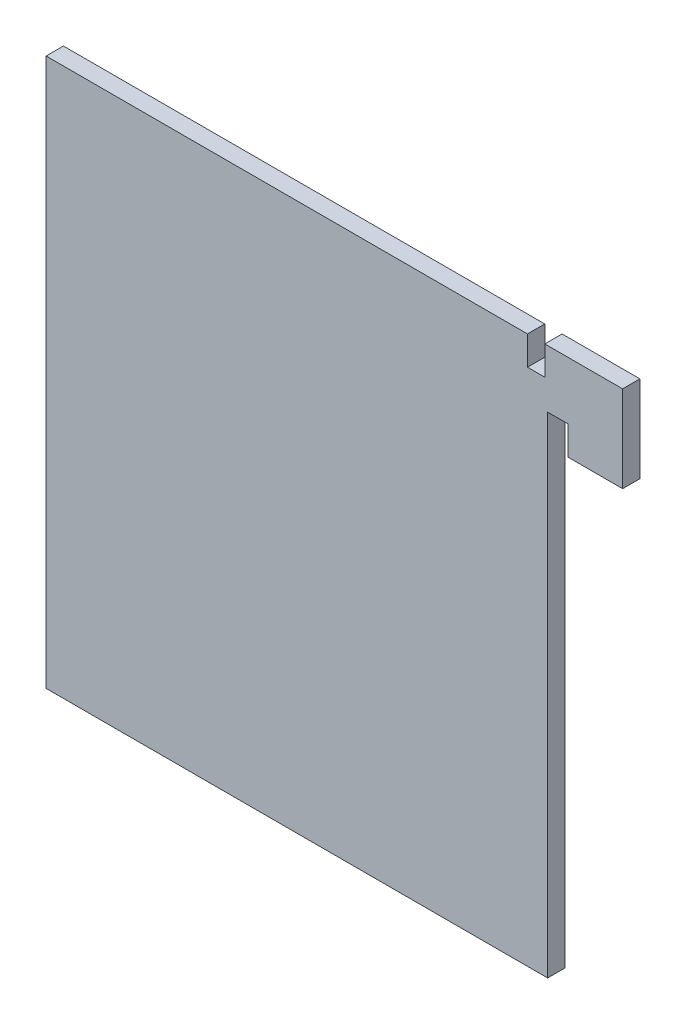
ISO-10303-21;
HEADER;
FILE_DESCRIPTION(('STEP AP214'),'2;1');
FILE_NAME('part.step','',(''),(''),'','','');
FILE_SCHEMA(('AUTOMOTIVE_DESIGN { 1 0 10303 214 1 1 1 1 }'));
ENDSEC;
DATA;
#1=APPLICATION_CONTEXT('core data for automotive mechanical design processes');
#2=APPLICATION_PROTOCOL_DEFINITION('international standard','automotive_design',2000,#1);
#3=PRODUCT_CONTEXT('',#1,'mechanical');
#4=PRODUCT('Part','Part','',(#3));
#5=PRODUCT_RELATED_PRODUCT_CATEGORY('part','',(#4));
#6=PRODUCT_DEFINITION_FORMATION('','',#4);
#7=PRODUCT_DEFINITION_CONTEXT('part definition',#1,'design');
#8=PRODUCT_DEFINITION('design','',#6,#7);
#9=PRODUCT_DEFINITION_SHAPE('','',#8);
#10=(LENGTH_UNIT() NAMED_UNIT(*) SI_UNIT(.MILLI.,.METRE.));
#11=(NAMED_UNIT(*) PLANE_ANGLE_UNIT() SI_UNIT($,.RADIAN.));
#12=(NAMED_UNIT(*) SI_UNIT($,.STERADIAN.) SOLID_ANGLE_UNIT());
#13=UNCERTAINTY_MEASURE_WITH_UNIT(LENGTH_MEASURE(1.E-05),#10,'distance_accuracy_value','');
#14=(GEOMETRIC_REPRESENTATION_CONTEXT(3) GLOBAL_UNCERTAINTY_ASSIGNED_CONTEXT((#13)) GLOBAL_UNIT_ASSIGNED_CONTEXT((#10,
#11,#12)) REPRESENTATION_CONTEXT('',''));
#15=CARTESIAN_POINT('',(0.,0.,0.));
#16=DIRECTION('',(0.,0.,1.));
#17=DIRECTION('',(1.,0.,0.));
#18=AXIS2_PLACEMENT_3D('',#15,#16,#17);
#19=CARTESIAN_POINT('',(0.,95.,3.));
#20=DIRECTION('',(0.,-1.,0.));
#21=DIRECTION('',(0.,0.,-1.));
#22=AXIS2_PLACEMENT_3D('',#19,#20,#21);
#23=PLANE('',#22);
#24=DIRECTION('',(-1.,0.,0.));
#25=VECTOR('',#24,1.);
#26=CARTESIAN_POINT('',(0.,95.,3.));
#27=LINE('',#26,#25);
#28=CARTESIAN_POINT('',(83.5,95.,3.));
#29=VERTEX_POINT('',#28);
#30=CARTESIAN_POINT('',(0.,95.,3.));
#31=VERTEX_POINT('',#30);
#32=EDGE_CURVE('E195',#29,#31,#27,.T.);
#33=ORIENTED_EDGE('',*,*,#32,.F.);
#34=DIRECTION('',(0.,0.,1.));
#35=VECTOR('',#34,1.);
#36=CARTESIAN_POINT('',(83.5,95.,0.));
#37=LINE('',#36,#35);
#38=CARTESIAN_POINT('',(83.5,95.,0.));
#39=VERTEX_POINT('',#38);
#40=EDGE_CURVE('E177',#39,#29,#37,.T.);
#41=ORIENTED_EDGE('',*,*,#40,.F.);
#42=DIRECTION('',(-1.,0.,0.));
#43=VECTOR('',#42,1.);
#44=CARTESIAN_POINT('',(0.,95.,0.));
#45=LINE('',#44,#43);
#46=CARTESIAN_POINT('',(0.,95.,0.));
#47=VERTEX_POINT('',#46);
#48=EDGE_CURVE('E207',#39,#47,#45,.T.);
#49=ORIENTED_EDGE('',*,*,#48,.T.);
#50=DIRECTION('',(0.,0.,-1.));
#51=VECTOR('',#50,1.);
#52=CARTESIAN_POINT('',(0.,95.,3.));
#53=LINE('',#52,#51);
#54=EDGE_CURVE('E199',#31,#47,#53,.T.);
#55=ORIENTED_EDGE('',*,*,#54,.F.);
#56=EDGE_LOOP('',(#33,#41,#49,#55));
#57=FACE_BOUND('',#56,.T.);
#58=ADVANCED_FACE('F31',(#57),#23,.F.);
#59=CARTESIAN_POINT('',(0.,0.,3.));
#60=DIRECTION('',(1.,0.,0.));
#61=DIRECTION('',(0.,0.,-1.));
#62=AXIS2_PLACEMENT_3D('',#59,#60,#61);
#63=PLANE('',#62);
#64=DIRECTION('',(0.,-1.,0.));
#65=VECTOR('',#64,1.);
#66=CARTESIAN_POINT('',(0.,0.,0.));
#67=LINE('',#66,#65);
#68=CARTESIAN_POINT('',(0.,0.,0.));
#69=VERTEX_POINT('',#68);
#70=EDGE_CURVE('E179',#47,#69,#67,.T.);
#71=ORIENTED_EDGE('',*,*,#70,.T.);
#72=DIRECTION('',(0.,0.,-1.));
#73=VECTOR('',#72,1.);
#74=CARTESIAN_POINT('',(0.,0.,3.));
#75=LINE('',#74,#73);
#76=CARTESIAN_POINT('',(0.,0.,3.));
#77=VERTEX_POINT('',#76);
#78=EDGE_CURVE('E11',#77,#69,#75,.T.);
#79=ORIENTED_EDGE('',*,*,#78,.F.);
#80=DIRECTION('',(0.,-1.,0.));
#81=VECTOR('',#80,1.);
#82=CARTESIAN_POINT('',(0.,0.,3.));
#83=LINE('',#82,#81);
#84=EDGE_CURVE('E186',#31,#77,#83,.T.);
#85=ORIENTED_EDGE('',*,*,#84,.F.);
#86=ORIENTED_EDGE('',*,*,#54,.T.);
#87=EDGE_LOOP('',(#71,#79,#85,#86));
#88=FACE_BOUND('',#87,.T.);
#89=ADVANCED_FACE('F33',(#88),#63,.F.);
#90=CARTESIAN_POINT('',(0.,0.,3.));
#91=DIRECTION('',(0.,1.,0.));
#92=DIRECTION('',(0.,0.,1.));
#93=AXIS2_PLACEMENT_3D('',#90,#91,#92);
#94=PLANE('',#93);
#95=DIRECTION('',(1.,0.,0.));
#96=VECTOR('',#95,1.);
#97=CARTESIAN_POINT('',(0.,0.,0.));
#98=LINE('',#97,#96);
#99=CARTESIAN_POINT('',(87.,0.,0.));
#100=VERTEX_POINT('',#99);
#101=EDGE_CURVE('E202',#69,#100,#98,.T.);
#102=ORIENTED_EDGE('',*,*,#101,.T.);
#103=DIRECTION('',(0.,0.,1.));
#104=VECTOR('',#103,1.);
#105=CARTESIAN_POINT('',(87.,0.,0.));
#106=LINE('',#105,#104);
#107=CARTESIAN_POINT('',(87.,0.,3.));
#108=VERTEX_POINT('',#107);
#109=EDGE_CURVE('E157',#100,#108,#106,.T.);
#110=ORIENTED_EDGE('',*,*,#109,.T.);
#111=DIRECTION('',(1.,0.,0.));
#112=VECTOR('',#111,1.);
#113=CARTESIAN_POINT('',(0.,0.,3.));
#114=LINE('',#113,#112);
#115=EDGE_CURVE('E189',#77,#108,#114,.T.);
#116=ORIENTED_EDGE('',*,*,#115,.F.);
#117=ORIENTED_EDGE('',*,*,#78,.T.);
#118=EDGE_LOOP('',(#102,#110,#116,#117));
#119=FACE_BOUND('',#118,.T.);
#120=ADVANCED_FACE('F237',(#119),#94,.F.);
#121=CARTESIAN_POINT('',(100.,0.,3.));
#122=DIRECTION('',(-1.,0.,0.));
#123=DIRECTION('',(0.,0.,1.));
#124=AXIS2_PLACEMENT_3D('',#121,#122,#123);
#125=PLANE('',#124);
#126=DIRECTION('',(0.,1.,0.));
#127=VECTOR('',#126,1.);
#128=CARTESIAN_POINT('',(100.,0.,3.));
#129=LINE('',#128,#127);
#130=CARTESIAN_POINT('',(100.,80.,3.));
#131=VERTEX_POINT('',#130);
#132=CARTESIAN_POINT('',(100.,95.,3.));
#133=VERTEX_POINT('',#132);
#134=EDGE_CURVE('E193',#131,#133,#129,.T.);
#135=ORIENTED_EDGE('',*,*,#134,.F.);
#136=DIRECTION('',(0.,0.,1.));
#137=VECTOR('',#136,1.);
#138=CARTESIAN_POINT('',(100.,80.,0.));
#139=LINE('',#138,#137);
#140=CARTESIAN_POINT('',(100.,80.,0.));
#141=VERTEX_POINT('',#140);
#142=EDGE_CURVE('E153',#141,#131,#139,.T.);
#143=ORIENTED_EDGE('',*,*,#142,.F.);
#144=DIRECTION('',(0.,1.,0.));
#145=VECTOR('',#144,1.);
#146=CARTESIAN_POINT('',(100.,0.,0.));
#147=LINE('',#146,#145);
#148=CARTESIAN_POINT('',(100.,95.,0.));
#149=VERTEX_POINT('',#148);
#150=EDGE_CURVE('E205',#141,#149,#147,.T.);
#151=ORIENTED_EDGE('',*,*,#150,.T.);
#152=DIRECTION('',(0.,0.,-1.));
#153=VECTOR('',#152,1.);
#154=CARTESIAN_POINT('',(100.,95.,3.));
#155=LINE('',#154,#153);
#156=EDGE_CURVE('E39',#133,#149,#155,.T.);
#157=ORIENTED_EDGE('',*,*,#156,.F.);
#158=EDGE_LOOP('',(#135,#143,#151,#157));
#159=FACE_BOUND('',#158,.T.);
#160=ADVANCED_FACE('F230',(#159),#125,.F.);
#161=CARTESIAN_POINT('',(86.5,95.,0.));
#162=VERTEX_POINT('',#161);
#163=EDGE_CURVE('E190',#149,#162,#45,.T.);
#164=ORIENTED_EDGE('',*,*,#163,.T.);
#165=DIRECTION('',(0.,0.,1.));
#166=VECTOR('',#165,1.);
#167=CARTESIAN_POINT('',(86.5,95.,0.));
#168=LINE('',#167,#166);
#169=CARTESIAN_POINT('',(86.5,95.,3.));
#170=VERTEX_POINT('',#169);
#171=EDGE_CURVE('E180',#162,#170,#168,.T.);
#172=ORIENTED_EDGE('',*,*,#171,.T.);
#173=EDGE_CURVE('E196',#133,#170,#27,.T.);
#174=ORIENTED_EDGE('',*,*,#173,.F.);
#175=ORIENTED_EDGE('',*,*,#156,.T.);
#176=EDGE_LOOP('',(#164,#172,#174,#175));
#177=FACE_BOUND('',#176,.T.);
#178=ADVANCED_FACE('F216',(#177),#23,.F.);
#179=CARTESIAN_POINT('',(0.,95.,3.));
#180=DIRECTION('',(0.,0.,-1.));
#181=DIRECTION('',(-1.,0.,0.));
#182=AXIS2_PLACEMENT_3D('',#179,#180,#181);
#183=PLANE('',#182);
#184=DIRECTION('',(0.,-1.,0.));
#185=VECTOR('',#184,1.);
#186=CARTESIAN_POINT('',(87.,80.,3.));
#187=LINE('',#186,#185);
#188=CARTESIAN_POINT('',(87.,85.,3.));
#189=VERTEX_POINT('',#188);
#190=EDGE_CURVE('E151',#189,#108,#187,.T.);
#191=ORIENTED_EDGE('',*,*,#190,.F.);
#192=DIRECTION('',(-1.,0.,0.));
#193=VECTOR('',#192,1.);
#194=CARTESIAN_POINT('',(87.,85.,3.));
#195=LINE('',#194,#193);
#196=CARTESIAN_POINT('',(90.5,85.,3.));
#197=VERTEX_POINT('',#196);
#198=EDGE_CURVE('E141',#197,#189,#195,.T.);
#199=ORIENTED_EDGE('',*,*,#198,.F.);
#200=DIRECTION('',(0.,1.,0.));
#201=VECTOR('',#200,1.);
#202=CARTESIAN_POINT('',(90.5,80.,3.));
#203=LINE('',#202,#201);
#204=CARTESIAN_POINT('',(90.5,80.,3.));
#205=VERTEX_POINT('',#204);
#206=EDGE_CURVE('E122',#205,#197,#203,.T.);
#207=ORIENTED_EDGE('',*,*,#206,.F.);
#208=DIRECTION('',(-1.,0.,0.));
#209=VECTOR('',#208,1.);
#210=CARTESIAN_POINT('',(100.,80.,3.));
#211=LINE('',#210,#209);
#212=EDGE_CURVE('E146',#131,#205,#211,.T.);
#213=ORIENTED_EDGE('',*,*,#212,.F.);
#214=ORIENTED_EDGE('',*,*,#134,.T.);
#215=ORIENTED_EDGE('',*,*,#173,.T.);
#216=DIRECTION('',(0.,1.,0.));
#217=VECTOR('',#216,1.);
#218=CARTESIAN_POINT('',(86.5,95.,3.));
#219=LINE('',#218,#217);
#220=CARTESIAN_POINT('',(86.5,90.,3.));
#221=VERTEX_POINT('',#220);
#222=EDGE_CURVE('E166',#221,#170,#219,.T.);
#223=ORIENTED_EDGE('',*,*,#222,.F.);
#224=DIRECTION('',(1.,0.,0.));
#225=VECTOR('',#224,1.);
#226=CARTESIAN_POINT('',(83.5,90.,3.));
#227=LINE('',#226,#225);
#228=CARTESIAN_POINT('',(83.5,90.,3.));
#229=VERTEX_POINT('',#228);
#230=EDGE_CURVE('E173',#229,#221,#227,.T.);
#231=ORIENTED_EDGE('',*,*,#230,.F.);
#232=DIRECTION('',(0.,-1.,0.));
#233=VECTOR('',#232,1.);
#234=CARTESIAN_POINT('',(83.5,95.,3.));
#235=LINE('',#234,#233);
#236=EDGE_CURVE('E160',#29,#229,#235,.T.);
#237=ORIENTED_EDGE('',*,*,#236,.F.);
#238=ORIENTED_EDGE('',*,*,#32,.T.);
#239=ORIENTED_EDGE('',*,*,#84,.T.);
#240=ORIENTED_EDGE('',*,*,#115,.T.);
#241=EDGE_LOOP('',(#191,#199,#207,#213,#214,#215,#223,#231,#237,#238,#239,#240));
#242=FACE_BOUND('',#241,.T.);
#243=ADVANCED_FACE('F227',(#242),#183,.F.);
#244=CARTESIAN_POINT('',(0.,95.,0.));
#245=DIRECTION('',(0.,0.,-1.));
#246=DIRECTION('',(-1.,0.,0.));
#247=AXIS2_PLACEMENT_3D('',#244,#245,#246);
#248=PLANE('',#247);
#249=DIRECTION('',(-1.,0.,0.));
#250=VECTOR('',#249,1.);
#251=CARTESIAN_POINT('',(87.,85.,0.));
#252=LINE('',#251,#250);
#253=CARTESIAN_POINT('',(90.5,85.,0.));
#254=VERTEX_POINT('',#253);
#255=CARTESIAN_POINT('',(87.,85.,0.));
#256=VERTEX_POINT('',#255);
#257=EDGE_CURVE('E131',#254,#256,#252,.T.);
#258=ORIENTED_EDGE('',*,*,#257,.T.);
#259=DIRECTION('',(0.,-1.,0.));
#260=VECTOR('',#259,1.);
#261=CARTESIAN_POINT('',(87.,80.,0.));
#262=LINE('',#261,#260);
#263=EDGE_CURVE('E150',#256,#100,#262,.T.);
#264=ORIENTED_EDGE('',*,*,#263,.T.);
#265=ORIENTED_EDGE('',*,*,#101,.F.);
#266=ORIENTED_EDGE('',*,*,#70,.F.);
#267=ORIENTED_EDGE('',*,*,#48,.F.);
#268=DIRECTION('',(0.,-1.,0.));
#269=VECTOR('',#268,1.);
#270=CARTESIAN_POINT('',(83.5,95.,0.));
#271=LINE('',#270,#269);
#272=CARTESIAN_POINT('',(83.5,90.,0.));
#273=VERTEX_POINT('',#272);
#274=EDGE_CURVE('E162',#39,#273,#271,.T.);
#275=ORIENTED_EDGE('',*,*,#274,.T.);
#276=DIRECTION('',(1.,0.,0.));
#277=VECTOR('',#276,1.);
#278=CARTESIAN_POINT('',(83.5,90.,0.));
#279=LINE('',#278,#277);
#280=CARTESIAN_POINT('',(86.5,90.,0.));
#281=VERTEX_POINT('',#280);
#282=EDGE_CURVE('E165',#273,#281,#279,.T.);
#283=ORIENTED_EDGE('',*,*,#282,.T.);
#284=DIRECTION('',(0.,1.,0.));
#285=VECTOR('',#284,1.);
#286=CARTESIAN_POINT('',(86.5,95.,0.));
#287=LINE('',#286,#285);
#288=EDGE_CURVE('E54',#281,#162,#287,.T.);
#289=ORIENTED_EDGE('',*,*,#288,.T.);
#290=ORIENTED_EDGE('',*,*,#163,.F.);
#291=ORIENTED_EDGE('',*,*,#150,.F.);
#292=DIRECTION('',(-1.,0.,0.));
#293=VECTOR('',#292,1.);
#294=CARTESIAN_POINT('',(100.,80.,0.));
#295=LINE('',#294,#293);
#296=CARTESIAN_POINT('',(90.5,80.,0.));
#297=VERTEX_POINT('',#296);
#298=EDGE_CURVE('E140',#141,#297,#295,.T.);
#299=ORIENTED_EDGE('',*,*,#298,.T.);
#300=DIRECTION('',(0.,1.,0.));
#301=VECTOR('',#300,1.);
#302=CARTESIAN_POINT('',(90.5,80.,0.));
#303=LINE('',#302,#301);
#304=EDGE_CURVE('E46',#297,#254,#303,.T.);
#305=ORIENTED_EDGE('',*,*,#304,.T.);
#306=EDGE_LOOP('',(#258,#264,#265,#266,#267,#275,#283,#289,#290,#291,#299,#305));
#307=FACE_BOUND('',#306,.T.);
#308=ADVANCED_FACE('F138',(#307),#248,.T.);
#309=CARTESIAN_POINT('',(83.5,95.,0.));
#310=DIRECTION('',(-1.,0.,0.));
#311=DIRECTION('',(0.,0.,1.));
#312=AXIS2_PLACEMENT_3D('',#309,#310,#311);
#313=PLANE('',#312);
#314=ORIENTED_EDGE('',*,*,#236,.T.);
#315=DIRECTION('',(0.,0.,1.));
#316=VECTOR('',#315,1.);
#317=CARTESIAN_POINT('',(83.5,90.,0.));
#318=LINE('',#317,#316);
#319=EDGE_CURVE('E170',#273,#229,#318,.T.);
#320=ORIENTED_EDGE('',*,*,#319,.F.);
#321=ORIENTED_EDGE('',*,*,#274,.F.);
#322=ORIENTED_EDGE('',*,*,#40,.T.);
#323=EDGE_LOOP('',(#314,#320,#321,#322));
#324=FACE_BOUND('',#323,.T.);
#325=ADVANCED_FACE('F247',(#324),#313,.F.);
#326=CARTESIAN_POINT('',(86.5,95.,0.));
#327=DIRECTION('',(1.,0.,0.));
#328=DIRECTION('',(0.,0.,-1.));
#329=AXIS2_PLACEMENT_3D('',#326,#327,#328);
#330=PLANE('',#329);
#331=ORIENTED_EDGE('',*,*,#222,.T.);
#332=ORIENTED_EDGE('',*,*,#171,.F.);
#333=ORIENTED_EDGE('',*,*,#288,.F.);
#334=DIRECTION('',(0.,0.,1.));
#335=VECTOR('',#334,1.);
#336=CARTESIAN_POINT('',(86.5,90.,0.));
#337=LINE('',#336,#335);
#338=EDGE_CURVE('E183',#281,#221,#337,.T.);
#339=ORIENTED_EDGE('',*,*,#338,.T.);
#340=EDGE_LOOP('',(#331,#332,#333,#339));
#341=FACE_BOUND('',#340,.T.);
#342=ADVANCED_FACE('F225',(#341),#330,.F.);
#343=CARTESIAN_POINT('',(83.5,90.,0.));
#344=DIRECTION('',(0.,-1.,0.));
#345=DIRECTION('',(0.,0.,-1.));
#346=AXIS2_PLACEMENT_3D('',#343,#344,#345);
#347=PLANE('',#346);
#348=ORIENTED_EDGE('',*,*,#230,.T.);
#349=ORIENTED_EDGE('',*,*,#338,.F.);
#350=ORIENTED_EDGE('',*,*,#282,.F.);
#351=ORIENTED_EDGE('',*,*,#319,.T.);
#352=EDGE_LOOP('',(#348,#349,#350,#351));
#353=FACE_BOUND('',#352,.T.);
#354=ADVANCED_FACE('F222',(#353),#347,.F.);
#355=CARTESIAN_POINT('',(87.,80.,0.));
#356=DIRECTION('',(-1.,0.,0.));
#357=DIRECTION('',(0.,0.,1.));
#358=AXIS2_PLACEMENT_3D('',#355,#356,#357);
#359=PLANE('',#358);
#360=ORIENTED_EDGE('',*,*,#190,.T.);
#361=ORIENTED_EDGE('',*,*,#109,.F.);
#362=ORIENTED_EDGE('',*,*,#263,.F.);
#363=DIRECTION('',(0.,0.,1.));
#364=VECTOR('',#363,1.);
#365=CARTESIAN_POINT('',(87.,85.,0.));
#366=LINE('',#365,#364);
#367=EDGE_CURVE('E126',#256,#189,#366,.T.);
#368=ORIENTED_EDGE('',*,*,#367,.T.);
#369=EDGE_LOOP('',(#360,#361,#362,#368));
#370=FACE_BOUND('',#369,.T.);
#371=ADVANCED_FACE('F234',(#370),#359,.F.);
#372=CARTESIAN_POINT('',(100.,80.,0.));
#373=DIRECTION('',(0.,1.,0.));
#374=DIRECTION('',(0.,0.,1.));
#375=AXIS2_PLACEMENT_3D('',#372,#373,#374);
#376=PLANE('',#375);
#377=ORIENTED_EDGE('',*,*,#212,.T.);
#378=DIRECTION('',(0.,0.,1.));
#379=VECTOR('',#378,1.);
#380=CARTESIAN_POINT('',(90.5,80.,0.));
#381=LINE('',#380,#379);
#382=EDGE_CURVE('E127',#297,#205,#381,.T.);
#383=ORIENTED_EDGE('',*,*,#382,.F.);
#384=ORIENTED_EDGE('',*,*,#298,.F.);
#385=ORIENTED_EDGE('',*,*,#142,.T.);
#386=EDGE_LOOP('',(#377,#383,#384,#385));
#387=FACE_BOUND('',#386,.T.);
#388=ADVANCED_FACE('F232',(#387),#376,.F.);
#389=CARTESIAN_POINT('',(87.,85.,0.));
#390=DIRECTION('',(0.,1.,0.));
#391=DIRECTION('',(0.,0.,1.));
#392=AXIS2_PLACEMENT_3D('',#389,#390,#391);
#393=PLANE('',#392);
#394=ORIENTED_EDGE('',*,*,#198,.T.);
#395=ORIENTED_EDGE('',*,*,#367,.F.);
#396=ORIENTED_EDGE('',*,*,#257,.F.);
#397=DIRECTION('',(0.,0.,1.));
#398=VECTOR('',#397,1.);
#399=CARTESIAN_POINT('',(90.5,85.,0.));
#400=LINE('',#399,#398);
#401=EDGE_CURVE('E118',#254,#197,#400,.T.);
#402=ORIENTED_EDGE('',*,*,#401,.T.);
#403=EDGE_LOOP('',(#394,#395,#396,#402));
#404=FACE_BOUND('',#403,.T.);
#405=ADVANCED_FACE('F132',(#404),#393,.F.);
#406=CARTESIAN_POINT('',(90.5,80.,0.));
#407=DIRECTION('',(1.,0.,0.));
#408=DIRECTION('',(0.,0.,-1.));
#409=AXIS2_PLACEMENT_3D('',#406,#407,#408);
#410=PLANE('',#409);
#411=ORIENTED_EDGE('',*,*,#206,.T.);
#412=ORIENTED_EDGE('',*,*,#401,.F.);
#413=ORIENTED_EDGE('',*,*,#304,.F.);
#414=ORIENTED_EDGE('',*,*,#382,.T.);
#415=EDGE_LOOP('',(#411,#412,#413,#414));
#416=FACE_BOUND('',#415,.T.);
#417=ADVANCED_FACE('F120',(#416),#410,.F.);
#418=CLOSED_SHELL('',(#58,#89,#120,#160,#178,#243,#308,#325,#342,#354,#371,#388,#405,#417));
#419=MANIFOLD_SOLID_BREP('B2',#418);
#420=ADVANCED_BREP_SHAPE_REPRESENTATION('',(#18,#419),#14);
#421=SHAPE_DEFINITION_REPRESENTATION(#9,#420);
ENDSEC;
END-ISO-10303-21;
